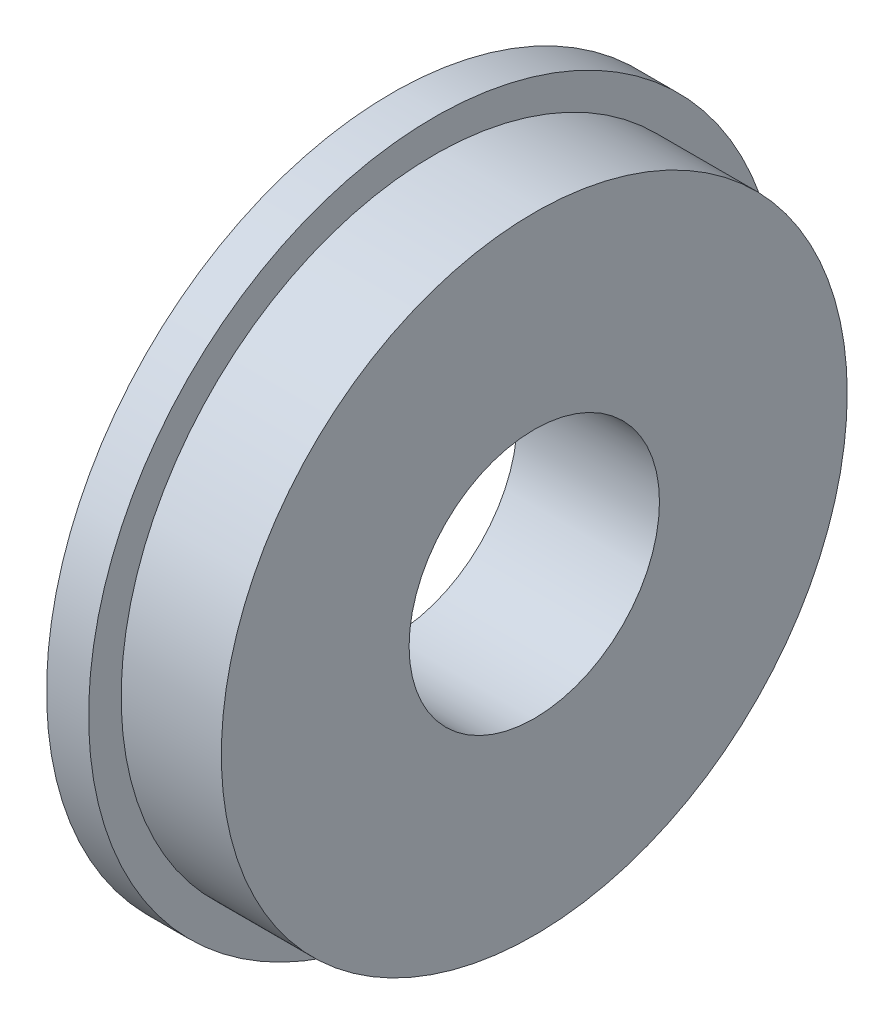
from build123d import *


with BuildPart() as part:
    # Sketch1 → Revolve1 (revolve)
    with BuildSketch(Plane(origin=(0, 0, 0), x_dir=(1, 0, 0), z_dir=(0, 1, 0))):
        Polygon((0, 7.9375), (0, 3.175), (-3.6068, 3.175), (-3.6068, 8.763), (-2.54, 8.763), (-2.54, 7.9375), align=None)
    revolve(axis=Axis((0, 0, 0), (-1, 0, 0)))


solid = part.part
